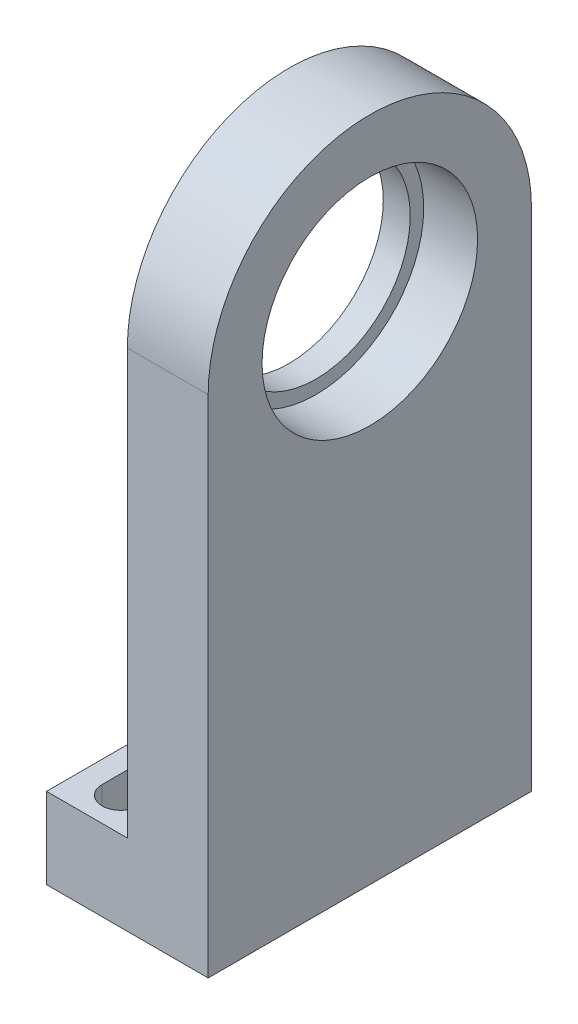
ISO-10303-21;
HEADER;
FILE_DESCRIPTION(('STEP AP214'),'2;1');
FILE_NAME('part.step','',(''),(''),'','','');
FILE_SCHEMA(('AUTOMOTIVE_DESIGN { 1 0 10303 214 1 1 1 1 }'));
ENDSEC;
DATA;
#1=APPLICATION_CONTEXT('core data for automotive mechanical design processes');
#2=APPLICATION_PROTOCOL_DEFINITION('international standard','automotive_design',2000,#1);
#3=PRODUCT_CONTEXT('',#1,'mechanical');
#4=PRODUCT('Part','Part','',(#3));
#5=PRODUCT_RELATED_PRODUCT_CATEGORY('part','',(#4));
#6=PRODUCT_DEFINITION_FORMATION('','',#4);
#7=PRODUCT_DEFINITION_CONTEXT('part definition',#1,'design');
#8=PRODUCT_DEFINITION('design','',#6,#7);
#9=PRODUCT_DEFINITION_SHAPE('','',#8);
#10=(LENGTH_UNIT() NAMED_UNIT(*) SI_UNIT(.MILLI.,.METRE.));
#11=(NAMED_UNIT(*) PLANE_ANGLE_UNIT() SI_UNIT($,.RADIAN.));
#12=(NAMED_UNIT(*) SI_UNIT($,.STERADIAN.) SOLID_ANGLE_UNIT());
#13=UNCERTAINTY_MEASURE_WITH_UNIT(LENGTH_MEASURE(1.E-05),#10,'distance_accuracy_value','');
#14=(GEOMETRIC_REPRESENTATION_CONTEXT(3) GLOBAL_UNCERTAINTY_ASSIGNED_CONTEXT((#13)) GLOBAL_UNIT_ASSIGNED_CONTEXT((#10,
#11,#12)) REPRESENTATION_CONTEXT('',''));
#15=CARTESIAN_POINT('',(0.,0.,0.));
#16=DIRECTION('',(0.,0.,1.));
#17=DIRECTION('',(1.,0.,0.));
#18=AXIS2_PLACEMENT_3D('',#15,#16,#17);
#19=CARTESIAN_POINT('',(-12.,25.,50.));
#20=DIRECTION('',(1.,0.,0.));
#21=DIRECTION('',(0.,1.,0.));
#22=AXIS2_PLACEMENT_3D('',#19,#20,#21);
#23=CYLINDRICAL_SURFACE('',#22,14.);
#24=CARTESIAN_POINT('',(3.99999999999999,25.,50.));
#25=DIRECTION('',(1.,0.,0.));
#26=DIRECTION('',(0.,1.,0.));
#27=AXIS2_PLACEMENT_3D('',#24,#25,#26);
#28=CIRCLE('',#27,14.);
#29=CARTESIAN_POINT('',(3.99999999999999,39.,50.));
#30=VERTEX_POINT('',#29);
#31=EDGE_CURVE('E194',#30,#30,#28,.F.);
#32=ORIENTED_EDGE('',*,*,#31,.F.);
#33=EDGE_LOOP('',(#32));
#34=FACE_BOUND('',#33,.T.);
#35=CARTESIAN_POINT('',(0.,25.,50.));
#36=DIRECTION('',(1.,0.,0.));
#37=DIRECTION('',(0.,1.,0.));
#38=AXIS2_PLACEMENT_3D('',#35,#36,#37);
#39=CIRCLE('',#38,14.);
#40=CARTESIAN_POINT('',(0.,39.,50.));
#41=VERTEX_POINT('',#40);
#42=EDGE_CURVE('E20',#41,#41,#39,.F.);
#43=ORIENTED_EDGE('',*,*,#42,.T.);
#44=EDGE_LOOP('',(#43));
#45=FACE_BOUND('',#44,.T.);
#46=ADVANCED_FACE('F17',(#34,#45),#23,.F.);
#47=CARTESIAN_POINT('',(-5.99999999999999,-50.,69.));
#48=DIRECTION('',(0.,1.,0.));
#49=DIRECTION('',(0.,0.,1.));
#50=AXIS2_PLACEMENT_3D('',#47,#48,#49);
#51=CYLINDRICAL_SURFACE('',#50,2.75);
#52=CARTESIAN_POINT('',(-5.99999999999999,-50.,69.));
#53=DIRECTION('',(0.,1.,0.));
#54=DIRECTION('',(0.,0.,1.));
#55=AXIS2_PLACEMENT_3D('',#52,#53,#54);
#56=CIRCLE('',#55,2.75);
#57=CARTESIAN_POINT('',(-3.24999999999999,-50.,69.));
#58=VERTEX_POINT('',#57);
#59=CARTESIAN_POINT('',(-8.75,-50.,69.));
#60=VERTEX_POINT('',#59);
#61=EDGE_CURVE('E191',#58,#60,#56,.F.);
#62=ORIENTED_EDGE('',*,*,#61,.T.);
#63=DIRECTION('',(0.,1.,0.));
#64=VECTOR('',#63,1.);
#65=CARTESIAN_POINT('',(-8.75,-50.,69.));
#66=LINE('',#65,#64);
#67=CARTESIAN_POINT('',(-8.75,-38.,69.));
#68=VERTEX_POINT('',#67);
#69=EDGE_CURVE('E166',#60,#68,#66,.T.);
#70=ORIENTED_EDGE('',*,*,#69,.T.);
#71=CARTESIAN_POINT('',(-5.99999999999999,-38.,69.));
#72=DIRECTION('',(0.,1.,0.));
#73=DIRECTION('',(0.,0.,1.));
#74=AXIS2_PLACEMENT_3D('',#71,#72,#73);
#75=CIRCLE('',#74,2.75);
#76=CARTESIAN_POINT('',(-3.24999999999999,-38.,69.));
#77=VERTEX_POINT('',#76);
#78=EDGE_CURVE('E124',#77,#68,#75,.F.);
#79=ORIENTED_EDGE('',*,*,#78,.F.);
#80=DIRECTION('',(0.,1.,0.));
#81=VECTOR('',#80,1.);
#82=CARTESIAN_POINT('',(-3.24999999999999,-50.,69.));
#83=LINE('',#82,#81);
#84=EDGE_CURVE('E119',#77,#58,#83,.F.);
#85=ORIENTED_EDGE('',*,*,#84,.T.);
#86=EDGE_LOOP('',(#62,#70,#79,#85));
#87=FACE_BOUND('',#86,.T.);
#88=ADVANCED_FACE('F331',(#87),#51,.F.);
#89=CARTESIAN_POINT('',(-8.75,-50.,57.));
#90=DIRECTION('',(-1.,0.,0.));
#91=DIRECTION('',(0.,0.,1.));
#92=AXIS2_PLACEMENT_3D('',#89,#90,#91);
#93=PLANE('',#92);
#94=ORIENTED_EDGE('',*,*,#69,.F.);
#95=DIRECTION('',(0.,0.,1.));
#96=VECTOR('',#95,1.);
#97=CARTESIAN_POINT('',(-8.75,-50.,100.));
#98=LINE('',#97,#96);
#99=CARTESIAN_POINT('',(-8.75,-50.,57.));
#100=VERTEX_POINT('',#99);
#101=EDGE_CURVE('E190',#60,#100,#98,.F.);
#102=ORIENTED_EDGE('',*,*,#101,.T.);
#103=DIRECTION('',(0.,1.,0.));
#104=VECTOR('',#103,1.);
#105=CARTESIAN_POINT('',(-8.75,-50.,57.));
#106=LINE('',#105,#104);
#107=CARTESIAN_POINT('',(-8.75,-38.,57.));
#108=VERTEX_POINT('',#107);
#109=EDGE_CURVE('E97',#100,#108,#106,.T.);
#110=ORIENTED_EDGE('',*,*,#109,.T.);
#111=DIRECTION('',(0.,0.,1.));
#112=VECTOR('',#111,1.);
#113=CARTESIAN_POINT('',(-8.75,-38.,0.));
#114=LINE('',#113,#112);
#115=EDGE_CURVE('E108',#68,#108,#114,.F.);
#116=ORIENTED_EDGE('',*,*,#115,.F.);
#117=EDGE_LOOP('',(#94,#102,#110,#116));
#118=FACE_BOUND('',#117,.T.);
#119=ADVANCED_FACE('F362',(#118),#93,.F.);
#120=CARTESIAN_POINT('',(-6.,-50.,57.));
#121=DIRECTION('',(0.,1.,0.));
#122=DIRECTION('',(0.,0.,1.));
#123=AXIS2_PLACEMENT_3D('',#120,#121,#122);
#124=CYLINDRICAL_SURFACE('',#123,2.75);
#125=ORIENTED_EDGE('',*,*,#109,.F.);
#126=CARTESIAN_POINT('',(-6.,-50.,57.));
#127=DIRECTION('',(0.,1.,0.));
#128=DIRECTION('',(0.,0.,1.));
#129=AXIS2_PLACEMENT_3D('',#126,#127,#128);
#130=CIRCLE('',#129,2.75);
#131=CARTESIAN_POINT('',(-3.25,-50.,57.));
#132=VERTEX_POINT('',#131);
#133=EDGE_CURVE('E114',#100,#132,#130,.F.);
#134=ORIENTED_EDGE('',*,*,#133,.T.);
#135=DIRECTION('',(0.,1.,0.));
#136=VECTOR('',#135,1.);
#137=CARTESIAN_POINT('',(-3.25,-50.,57.));
#138=LINE('',#137,#136);
#139=CARTESIAN_POINT('',(-3.25,-38.,57.));
#140=VERTEX_POINT('',#139);
#141=EDGE_CURVE('E111',#132,#140,#138,.T.);
#142=ORIENTED_EDGE('',*,*,#141,.T.);
#143=CARTESIAN_POINT('',(-6.,-38.,57.));
#144=DIRECTION('',(0.,1.,0.));
#145=DIRECTION('',(0.,0.,1.));
#146=AXIS2_PLACEMENT_3D('',#143,#144,#145);
#147=CIRCLE('',#146,2.75);
#148=EDGE_CURVE('E103',#108,#140,#147,.F.);
#149=ORIENTED_EDGE('',*,*,#148,.F.);
#150=EDGE_LOOP('',(#125,#134,#142,#149));
#151=FACE_BOUND('',#150,.T.);
#152=ADVANCED_FACE('F112',(#151),#124,.F.);
#153=CARTESIAN_POINT('',(-3.25,-50.,57.));
#154=DIRECTION('',(1.,0.,0.));
#155=DIRECTION('',(0.,0.,-1.));
#156=AXIS2_PLACEMENT_3D('',#153,#154,#155);
#157=PLANE('',#156);
#158=ORIENTED_EDGE('',*,*,#141,.F.);
#159=DIRECTION('',(0.,0.,1.));
#160=VECTOR('',#159,1.);
#161=CARTESIAN_POINT('',(-3.24999999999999,-50.,100.));
#162=LINE('',#161,#160);
#163=EDGE_CURVE('E188',#132,#58,#162,.T.);
#164=ORIENTED_EDGE('',*,*,#163,.T.);
#165=ORIENTED_EDGE('',*,*,#84,.F.);
#166=DIRECTION('',(0.,0.,1.));
#167=VECTOR('',#166,1.);
#168=CARTESIAN_POINT('',(-3.25,-38.,0.));
#169=LINE('',#168,#167);
#170=EDGE_CURVE('E107',#140,#77,#169,.T.);
#171=ORIENTED_EDGE('',*,*,#170,.F.);
#172=EDGE_LOOP('',(#158,#164,#165,#171));
#173=FACE_BOUND('',#172,.T.);
#174=ADVANCED_FACE('F122',(#173),#157,.F.);
#175=CARTESIAN_POINT('',(-6.,-50.,43.));
#176=DIRECTION('',(0.,1.,0.));
#177=DIRECTION('',(0.,0.,1.));
#178=AXIS2_PLACEMENT_3D('',#175,#176,#177);
#179=CYLINDRICAL_SURFACE('',#178,2.75);
#180=CARTESIAN_POINT('',(-6.,-50.,43.));
#181=DIRECTION('',(0.,1.,0.));
#182=DIRECTION('',(0.,0.,1.));
#183=AXIS2_PLACEMENT_3D('',#180,#181,#182);
#184=CIRCLE('',#183,2.75);
#185=CARTESIAN_POINT('',(-3.25,-50.,43.));
#186=VERTEX_POINT('',#185);
#187=CARTESIAN_POINT('',(-8.75,-50.,43.));
#188=VERTEX_POINT('',#187);
#189=EDGE_CURVE('E185',#186,#188,#184,.F.);
#190=ORIENTED_EDGE('',*,*,#189,.T.);
#191=DIRECTION('',(0.,1.,0.));
#192=VECTOR('',#191,1.);
#193=CARTESIAN_POINT('',(-8.75,-50.,43.));
#194=LINE('',#193,#192);
#195=CARTESIAN_POINT('',(-8.75,-38.,43.));
#196=VERTEX_POINT('',#195);
#197=EDGE_CURVE('E118',#188,#196,#194,.T.);
#198=ORIENTED_EDGE('',*,*,#197,.T.);
#199=CARTESIAN_POINT('',(-6.,-38.,43.));
#200=DIRECTION('',(0.,1.,0.));
#201=DIRECTION('',(0.,0.,1.));
#202=AXIS2_PLACEMENT_3D('',#199,#200,#201);
#203=CIRCLE('',#202,2.75);
#204=CARTESIAN_POINT('',(-3.25,-38.,43.));
#205=VERTEX_POINT('',#204);
#206=EDGE_CURVE('E197',#205,#196,#203,.F.);
#207=ORIENTED_EDGE('',*,*,#206,.F.);
#208=DIRECTION('',(0.,1.,0.));
#209=VECTOR('',#208,1.);
#210=CARTESIAN_POINT('',(-3.25,-50.,43.));
#211=LINE('',#210,#209);
#212=EDGE_CURVE('E157',#205,#186,#211,.F.);
#213=ORIENTED_EDGE('',*,*,#212,.T.);
#214=EDGE_LOOP('',(#190,#198,#207,#213));
#215=FACE_BOUND('',#214,.T.);
#216=ADVANCED_FACE('F353',(#215),#179,.F.);
#217=CARTESIAN_POINT('',(-8.75,-50.,31.));
#218=DIRECTION('',(-1.,0.,0.));
#219=DIRECTION('',(0.,0.,1.));
#220=AXIS2_PLACEMENT_3D('',#217,#218,#219);
#221=PLANE('',#220);
#222=ORIENTED_EDGE('',*,*,#197,.F.);
#223=DIRECTION('',(0.,0.,1.));
#224=VECTOR('',#223,1.);
#225=CARTESIAN_POINT('',(-8.75,-50.,100.));
#226=LINE('',#225,#224);
#227=CARTESIAN_POINT('',(-8.75,-50.,31.));
#228=VERTEX_POINT('',#227);
#229=EDGE_CURVE('E184',#188,#228,#226,.F.);
#230=ORIENTED_EDGE('',*,*,#229,.T.);
#231=DIRECTION('',(0.,1.,0.));
#232=VECTOR('',#231,1.);
#233=CARTESIAN_POINT('',(-8.75,-50.,31.));
#234=LINE('',#233,#232);
#235=CARTESIAN_POINT('',(-8.75,-38.,31.));
#236=VERTEX_POINT('',#235);
#237=EDGE_CURVE('E160',#228,#236,#234,.T.);
#238=ORIENTED_EDGE('',*,*,#237,.T.);
#239=DIRECTION('',(0.,0.,1.));
#240=VECTOR('',#239,1.);
#241=CARTESIAN_POINT('',(-8.75,-38.,0.));
#242=LINE('',#241,#240);
#243=EDGE_CURVE('E134',#196,#236,#242,.F.);
#244=ORIENTED_EDGE('',*,*,#243,.F.);
#245=EDGE_LOOP('',(#222,#230,#238,#244));
#246=FACE_BOUND('',#245,.T.);
#247=ADVANCED_FACE('F349',(#246),#221,.F.);
#248=CARTESIAN_POINT('',(-6.,-50.,31.));
#249=DIRECTION('',(0.,1.,0.));
#250=DIRECTION('',(0.,0.,1.));
#251=AXIS2_PLACEMENT_3D('',#248,#249,#250);
#252=CYLINDRICAL_SURFACE('',#251,2.75);
#253=ORIENTED_EDGE('',*,*,#237,.F.);
#254=CARTESIAN_POINT('',(-6.,-50.,31.));
#255=DIRECTION('',(0.,1.,0.));
#256=DIRECTION('',(0.,0.,1.));
#257=AXIS2_PLACEMENT_3D('',#254,#255,#256);
#258=CIRCLE('',#257,2.75);
#259=CARTESIAN_POINT('',(-3.25,-50.,31.));
#260=VERTEX_POINT('',#259);
#261=EDGE_CURVE('E180',#228,#260,#258,.F.);
#262=ORIENTED_EDGE('',*,*,#261,.T.);
#263=DIRECTION('',(0.,1.,0.));
#264=VECTOR('',#263,1.);
#265=CARTESIAN_POINT('',(-3.25,-50.,31.));
#266=LINE('',#265,#264);
#267=CARTESIAN_POINT('',(-3.25,-38.,31.));
#268=VERTEX_POINT('',#267);
#269=EDGE_CURVE('E154',#260,#268,#266,.T.);
#270=ORIENTED_EDGE('',*,*,#269,.T.);
#271=CARTESIAN_POINT('',(-6.,-38.,31.));
#272=DIRECTION('',(0.,1.,0.));
#273=DIRECTION('',(0.,0.,1.));
#274=AXIS2_PLACEMENT_3D('',#271,#272,#273);
#275=CIRCLE('',#274,2.75);
#276=EDGE_CURVE('E200',#236,#268,#275,.F.);
#277=ORIENTED_EDGE('',*,*,#276,.F.);
#278=EDGE_LOOP('',(#253,#262,#270,#277));
#279=FACE_BOUND('',#278,.T.);
#280=ADVANCED_FACE('F342',(#279),#252,.F.);
#281=CARTESIAN_POINT('',(-3.25,-50.,31.));
#282=DIRECTION('',(1.,0.,0.));
#283=DIRECTION('',(0.,0.,-1.));
#284=AXIS2_PLACEMENT_3D('',#281,#282,#283);
#285=PLANE('',#284);
#286=ORIENTED_EDGE('',*,*,#269,.F.);
#287=DIRECTION('',(0.,0.,1.));
#288=VECTOR('',#287,1.);
#289=CARTESIAN_POINT('',(-3.25,-50.,100.));
#290=LINE('',#289,#288);
#291=EDGE_CURVE('E183',#260,#186,#290,.T.);
#292=ORIENTED_EDGE('',*,*,#291,.T.);
#293=ORIENTED_EDGE('',*,*,#212,.F.);
#294=DIRECTION('',(0.,0.,1.));
#295=VECTOR('',#294,1.);
#296=CARTESIAN_POINT('',(-3.25,-38.,0.));
#297=LINE('',#296,#295);
#298=EDGE_CURVE('E199',#268,#205,#297,.T.);
#299=ORIENTED_EDGE('',*,*,#298,.F.);
#300=EDGE_LOOP('',(#286,#292,#293,#299));
#301=FACE_BOUND('',#300,.T.);
#302=ADVANCED_FACE('F335',(#301),#285,.F.);
#303=CARTESIAN_POINT('',(0.,50.,0.));
#304=DIRECTION('',(1.,0.,0.));
#305=DIRECTION('',(0.,1.,0.));
#306=AXIS2_PLACEMENT_3D('',#303,#304,#305);
#307=PLANE('',#306);
#308=DIRECTION('',(0.,1.,0.));
#309=VECTOR('',#308,1.);
#310=CARTESIAN_POINT('',(0.,25.0000000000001,26.));
#311=LINE('',#310,#309);
#312=CARTESIAN_POINT('',(0.,25.0000000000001,26.));
#313=VERTEX_POINT('',#312);
#314=CARTESIAN_POINT('',(0.,-38.,26.));
#315=VERTEX_POINT('',#314);
#316=EDGE_CURVE('E178',#313,#315,#311,.F.);
#317=ORIENTED_EDGE('',*,*,#316,.T.);
#318=DIRECTION('',(0.,0.,1.));
#319=VECTOR('',#318,1.);
#320=CARTESIAN_POINT('',(0.,-38.,0.));
#321=LINE('',#320,#319);
#322=CARTESIAN_POINT('',(0.,-38.,74.));
#323=VERTEX_POINT('',#322);
#324=EDGE_CURVE('E130',#323,#315,#321,.F.);
#325=ORIENTED_EDGE('',*,*,#324,.F.);
#326=DIRECTION('',(0.,1.,0.));
#327=VECTOR('',#326,1.);
#328=CARTESIAN_POINT('',(0.,24.9999999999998,74.));
#329=LINE('',#328,#327);
#330=CARTESIAN_POINT('',(0.,25.,74.));
#331=VERTEX_POINT('',#330);
#332=EDGE_CURVE('E137',#331,#323,#329,.F.);
#333=ORIENTED_EDGE('',*,*,#332,.F.);
#334=CARTESIAN_POINT('',(0.,25.,50.));
#335=DIRECTION('',(1.,0.,0.));
#336=DIRECTION('',(0.,1.,0.));
#337=AXIS2_PLACEMENT_3D('',#334,#335,#336);
#338=CIRCLE('',#337,24.);
#339=EDGE_CURVE('E176',#313,#331,#338,.T.);
#340=ORIENTED_EDGE('',*,*,#339,.F.);
#341=EDGE_LOOP('',(#317,#325,#333,#340));
#342=FACE_BOUND('',#341,.T.);
#343=ORIENTED_EDGE('',*,*,#42,.F.);
#344=EDGE_LOOP('',(#343));
#345=FACE_BOUND('',#344,.T.);
#346=ADVANCED_FACE('F294',(#342,#345),#307,.F.);
#347=CARTESIAN_POINT('',(0.,-38.,0.));
#348=DIRECTION('',(0.,1.,0.));
#349=DIRECTION('',(0.,0.,1.));
#350=AXIS2_PLACEMENT_3D('',#347,#348,#349);
#351=PLANE('',#350);
#352=DIRECTION('',(1.,0.,0.));
#353=VECTOR('',#352,1.);
#354=CARTESIAN_POINT('',(-117.361283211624,-38.,74.));
#355=LINE('',#354,#353);
#356=CARTESIAN_POINT('',(-12.,-38.,74.));
#357=VERTEX_POINT('',#356);
#358=EDGE_CURVE('E140',#323,#357,#355,.F.);
#359=ORIENTED_EDGE('',*,*,#358,.F.);
#360=ORIENTED_EDGE('',*,*,#324,.T.);
#361=DIRECTION('',(1.,0.,0.));
#362=VECTOR('',#361,1.);
#363=CARTESIAN_POINT('',(-12.,-38.,26.));
#364=LINE('',#363,#362);
#365=CARTESIAN_POINT('',(-12.,-38.,26.));
#366=VERTEX_POINT('',#365);
#367=EDGE_CURVE('E210',#315,#366,#364,.F.);
#368=ORIENTED_EDGE('',*,*,#367,.T.);
#369=DIRECTION('',(0.,0.,1.));
#370=VECTOR('',#369,1.);
#371=CARTESIAN_POINT('',(-12.,-38.,100.));
#372=LINE('',#371,#370);
#373=EDGE_CURVE('E133',#366,#357,#372,.T.);
#374=ORIENTED_EDGE('',*,*,#373,.T.);
#375=EDGE_LOOP('',(#359,#360,#368,#374));
#376=FACE_BOUND('',#375,.T.);
#377=ORIENTED_EDGE('',*,*,#206,.T.);
#378=ORIENTED_EDGE('',*,*,#243,.T.);
#379=ORIENTED_EDGE('',*,*,#276,.T.);
#380=ORIENTED_EDGE('',*,*,#298,.T.);
#381=EDGE_LOOP('',(#377,#378,#379,#380));
#382=FACE_BOUND('',#381,.T.);
#383=ORIENTED_EDGE('',*,*,#78,.T.);
#384=ORIENTED_EDGE('',*,*,#115,.T.);
#385=ORIENTED_EDGE('',*,*,#148,.T.);
#386=ORIENTED_EDGE('',*,*,#170,.T.);
#387=EDGE_LOOP('',(#383,#384,#385,#386));
#388=FACE_BOUND('',#387,.T.);
#389=ADVANCED_FACE('F105',(#376,#382,#388),#351,.T.);
#390=CARTESIAN_POINT('',(-12.,50.,100.));
#391=DIRECTION('',(1.,0.,0.));
#392=DIRECTION('',(0.,1.,0.));
#393=AXIS2_PLACEMENT_3D('',#390,#391,#392);
#394=PLANE('',#393);
#395=DIRECTION('',(0.,1.,0.));
#396=VECTOR('',#395,1.);
#397=CARTESIAN_POINT('',(-12.,25.0000000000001,26.));
#398=LINE('',#397,#396);
#399=CARTESIAN_POINT('',(-12.,-50.,26.));
#400=VERTEX_POINT('',#399);
#401=EDGE_CURVE('E213',#366,#400,#398,.F.);
#402=ORIENTED_EDGE('',*,*,#401,.T.);
#403=DIRECTION('',(0.,0.,1.));
#404=VECTOR('',#403,1.);
#405=CARTESIAN_POINT('',(-12.,-50.,100.));
#406=LINE('',#405,#404);
#407=CARTESIAN_POINT('',(-12.,-50.,74.));
#408=VERTEX_POINT('',#407);
#409=EDGE_CURVE('E141',#400,#408,#406,.T.);
#410=ORIENTED_EDGE('',*,*,#409,.T.);
#411=DIRECTION('',(0.,1.,0.));
#412=VECTOR('',#411,1.);
#413=CARTESIAN_POINT('',(-12.,24.9999999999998,74.));
#414=LINE('',#413,#412);
#415=EDGE_CURVE('E144',#357,#408,#414,.F.);
#416=ORIENTED_EDGE('',*,*,#415,.F.);
#417=ORIENTED_EDGE('',*,*,#373,.F.);
#418=EDGE_LOOP('',(#402,#410,#416,#417));
#419=FACE_BOUND('',#418,.T.);
#420=ADVANCED_FACE('F279',(#419),#394,.F.);
#421=CARTESIAN_POINT('',(4.,25.,50.));
#422=DIRECTION('',(1.,0.,0.));
#423=DIRECTION('',(0.,1.,0.));
#424=AXIS2_PLACEMENT_3D('',#421,#422,#423);
#425=PLANE('',#424);
#426=CARTESIAN_POINT('',(4.,25.,50.));
#427=DIRECTION('',(1.,0.,0.));
#428=DIRECTION('',(0.,1.,0.));
#429=AXIS2_PLACEMENT_3D('',#426,#427,#428);
#430=CIRCLE('',#429,16.);
#431=CARTESIAN_POINT('',(3.99999999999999,41.,50.));
#432=VERTEX_POINT('',#431);
#433=EDGE_CURVE('E171',#432,#432,#430,.T.);
#434=ORIENTED_EDGE('',*,*,#433,.T.);
#435=EDGE_LOOP('',(#434));
#436=FACE_BOUND('',#435,.T.);
#437=ORIENTED_EDGE('',*,*,#31,.T.);
#438=EDGE_LOOP('',(#437));
#439=FACE_BOUND('',#438,.T.);
#440=ADVANCED_FACE('F323',(#436,#439),#425,.T.);
#441=CARTESIAN_POINT('',(-12.,-50.,100.));
#442=DIRECTION('',(0.,1.,0.));
#443=DIRECTION('',(0.,0.,1.));
#444=AXIS2_PLACEMENT_3D('',#441,#442,#443);
#445=PLANE('',#444);
#446=DIRECTION('',(1.,0.,0.));
#447=VECTOR('',#446,1.);
#448=CARTESIAN_POINT('',(-12.,-50.,26.));
#449=LINE('',#448,#447);
#450=CARTESIAN_POINT('',(12.,-50.,26.));
#451=VERTEX_POINT('',#450);
#452=EDGE_CURVE('E222',#400,#451,#449,.T.);
#453=ORIENTED_EDGE('',*,*,#452,.T.);
#454=DIRECTION('',(0.,0.,1.));
#455=VECTOR('',#454,1.);
#456=CARTESIAN_POINT('',(12.,-50.,100.));
#457=LINE('',#456,#455);
#458=CARTESIAN_POINT('',(12.,-50.,74.));
#459=VERTEX_POINT('',#458);
#460=EDGE_CURVE('E174',#451,#459,#457,.T.);
#461=ORIENTED_EDGE('',*,*,#460,.T.);
#462=DIRECTION('',(1.,0.,0.));
#463=VECTOR('',#462,1.);
#464=CARTESIAN_POINT('',(-117.361283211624,-50.,74.));
#465=LINE('',#464,#463);
#466=EDGE_CURVE('E147',#408,#459,#465,.T.);
#467=ORIENTED_EDGE('',*,*,#466,.F.);
#468=ORIENTED_EDGE('',*,*,#409,.F.);
#469=EDGE_LOOP('',(#453,#461,#467,#468));
#470=FACE_BOUND('',#469,.T.);
#471=ORIENTED_EDGE('',*,*,#261,.F.);
#472=ORIENTED_EDGE('',*,*,#229,.F.);
#473=ORIENTED_EDGE('',*,*,#189,.F.);
#474=ORIENTED_EDGE('',*,*,#291,.F.);
#475=EDGE_LOOP('',(#471,#472,#473,#474));
#476=FACE_BOUND('',#475,.T.);
#477=ORIENTED_EDGE('',*,*,#133,.F.);
#478=ORIENTED_EDGE('',*,*,#101,.F.);
#479=ORIENTED_EDGE('',*,*,#61,.F.);
#480=ORIENTED_EDGE('',*,*,#163,.F.);
#481=EDGE_LOOP('',(#477,#478,#479,#480));
#482=FACE_BOUND('',#481,.T.);
#483=ADVANCED_FACE('F273',(#470,#476,#482),#445,.F.);
#484=CARTESIAN_POINT('',(-117.361283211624,24.9999999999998,74.));
#485=DIRECTION('',(0.,0.,1.));
#486=DIRECTION('',(1.,0.,0.));
#487=AXIS2_PLACEMENT_3D('',#484,#485,#486);
#488=PLANE('',#487);
#489=DIRECTION('',(0.,-1.,0.));
#490=VECTOR('',#489,1.);
#491=CARTESIAN_POINT('',(12.,50.,74.));
#492=LINE('',#491,#490);
#493=CARTESIAN_POINT('',(12.,25.,74.));
#494=VERTEX_POINT('',#493);
#495=EDGE_CURVE('E170',#459,#494,#492,.F.);
#496=ORIENTED_EDGE('',*,*,#495,.T.);
#497=DIRECTION('',(1.,0.,0.));
#498=VECTOR('',#497,1.);
#499=CARTESIAN_POINT('',(-12.,25.,74.));
#500=LINE('',#499,#498);
#501=EDGE_CURVE('E179',#331,#494,#500,.T.);
#502=ORIENTED_EDGE('',*,*,#501,.F.);
#503=ORIENTED_EDGE('',*,*,#332,.T.);
#504=ORIENTED_EDGE('',*,*,#358,.T.);
#505=ORIENTED_EDGE('',*,*,#415,.T.);
#506=ORIENTED_EDGE('',*,*,#466,.T.);
#507=EDGE_LOOP('',(#496,#502,#503,#504,#505,#506));
#508=FACE_BOUND('',#507,.T.);
#509=ADVANCED_FACE('F299',(#508),#488,.T.);
#510=CARTESIAN_POINT('',(-12.,25.,50.));
#511=DIRECTION('',(1.,0.,0.));
#512=DIRECTION('',(0.,1.,0.));
#513=AXIS2_PLACEMENT_3D('',#510,#511,#512);
#514=CYLINDRICAL_SURFACE('',#513,24.);
#515=CARTESIAN_POINT('',(12.,25.,50.));
#516=DIRECTION('',(1.,0.,0.));
#517=DIRECTION('',(0.,1.,0.));
#518=AXIS2_PLACEMENT_3D('',#515,#516,#517);
#519=CIRCLE('',#518,24.);
#520=CARTESIAN_POINT('',(12.,25.0000000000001,26.));
#521=VERTEX_POINT('',#520);
#522=EDGE_CURVE('E35',#494,#521,#519,.F.);
#523=ORIENTED_EDGE('',*,*,#522,.T.);
#524=DIRECTION('',(1.,0.,0.));
#525=VECTOR('',#524,1.);
#526=CARTESIAN_POINT('',(-12.,25.0000000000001,26.));
#527=LINE('',#526,#525);
#528=EDGE_CURVE('E175',#521,#313,#527,.F.);
#529=ORIENTED_EDGE('',*,*,#528,.T.);
#530=ORIENTED_EDGE('',*,*,#339,.T.);
#531=ORIENTED_EDGE('',*,*,#501,.T.);
#532=EDGE_LOOP('',(#523,#529,#530,#531));
#533=FACE_BOUND('',#532,.T.);
#534=ADVANCED_FACE('F297',(#533),#514,.T.);
#535=CARTESIAN_POINT('',(-12.,25.0000000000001,26.));
#536=DIRECTION('',(0.,0.,1.));
#537=DIRECTION('',(1.,0.,0.));
#538=AXIS2_PLACEMENT_3D('',#535,#536,#537);
#539=PLANE('',#538);
#540=DIRECTION('',(0.,-1.,0.));
#541=VECTOR('',#540,1.);
#542=CARTESIAN_POINT('',(12.,50.,26.));
#543=LINE('',#542,#541);
#544=EDGE_CURVE('E26',#521,#451,#543,.T.);
#545=ORIENTED_EDGE('',*,*,#544,.T.);
#546=ORIENTED_EDGE('',*,*,#452,.F.);
#547=ORIENTED_EDGE('',*,*,#401,.F.);
#548=ORIENTED_EDGE('',*,*,#367,.F.);
#549=ORIENTED_EDGE('',*,*,#316,.F.);
#550=ORIENTED_EDGE('',*,*,#528,.F.);
#551=EDGE_LOOP('',(#545,#546,#547,#548,#549,#550));
#552=FACE_BOUND('',#551,.T.);
#553=ADVANCED_FACE('F262',(#552),#539,.F.);
#554=CARTESIAN_POINT('',(4.,25.,50.));
#555=DIRECTION('',(1.,0.,0.));
#556=DIRECTION('',(0.,1.,0.));
#557=AXIS2_PLACEMENT_3D('',#554,#555,#556);
#558=CYLINDRICAL_SURFACE('',#557,16.);
#559=ORIENTED_EDGE('',*,*,#433,.F.);
#560=EDGE_LOOP('',(#559));
#561=FACE_BOUND('',#560,.T.);
#562=CARTESIAN_POINT('',(12.,25.,50.));
#563=DIRECTION('',(1.,0.,0.));
#564=DIRECTION('',(0.,1.,0.));
#565=AXIS2_PLACEMENT_3D('',#562,#563,#564);
#566=CIRCLE('',#565,16.);
#567=CARTESIAN_POINT('',(12.,41.,50.));
#568=VERTEX_POINT('',#567);
#569=EDGE_CURVE('E11',#568,#568,#566,.T.);
#570=ORIENTED_EDGE('',*,*,#569,.T.);
#571=EDGE_LOOP('',(#570));
#572=FACE_BOUND('',#571,.T.);
#573=ADVANCED_FACE('F306',(#561,#572),#558,.F.);
#574=CARTESIAN_POINT('',(12.,50.,100.));
#575=DIRECTION('',(-1.,0.,0.));
#576=DIRECTION('',(0.,-1.,0.));
#577=AXIS2_PLACEMENT_3D('',#574,#575,#576);
#578=PLANE('',#577);
#579=ORIENTED_EDGE('',*,*,#569,.F.);
#580=EDGE_LOOP('',(#579));
#581=FACE_BOUND('',#580,.T.);
#582=ORIENTED_EDGE('',*,*,#544,.F.);
#583=ORIENTED_EDGE('',*,*,#522,.F.);
#584=ORIENTED_EDGE('',*,*,#495,.F.);
#585=ORIENTED_EDGE('',*,*,#460,.F.);
#586=EDGE_LOOP('',(#582,#583,#584,#585));
#587=FACE_BOUND('',#586,.T.);
#588=ADVANCED_FACE('F268',(#581,#587),#578,.F.);
#589=CLOSED_SHELL('',(#46,#88,#119,#152,#174,#216,#247,#280,#302,#346,#389,#420,#440,#483,#509,
#534,#553,#573,#588));
#590=MANIFOLD_SOLID_BREP('B1',#589);
#591=ADVANCED_BREP_SHAPE_REPRESENTATION('',(#18,#590),#14);
#592=SHAPE_DEFINITION_REPRESENTATION(#9,#591);
ENDSEC;
END-ISO-10303-21;
